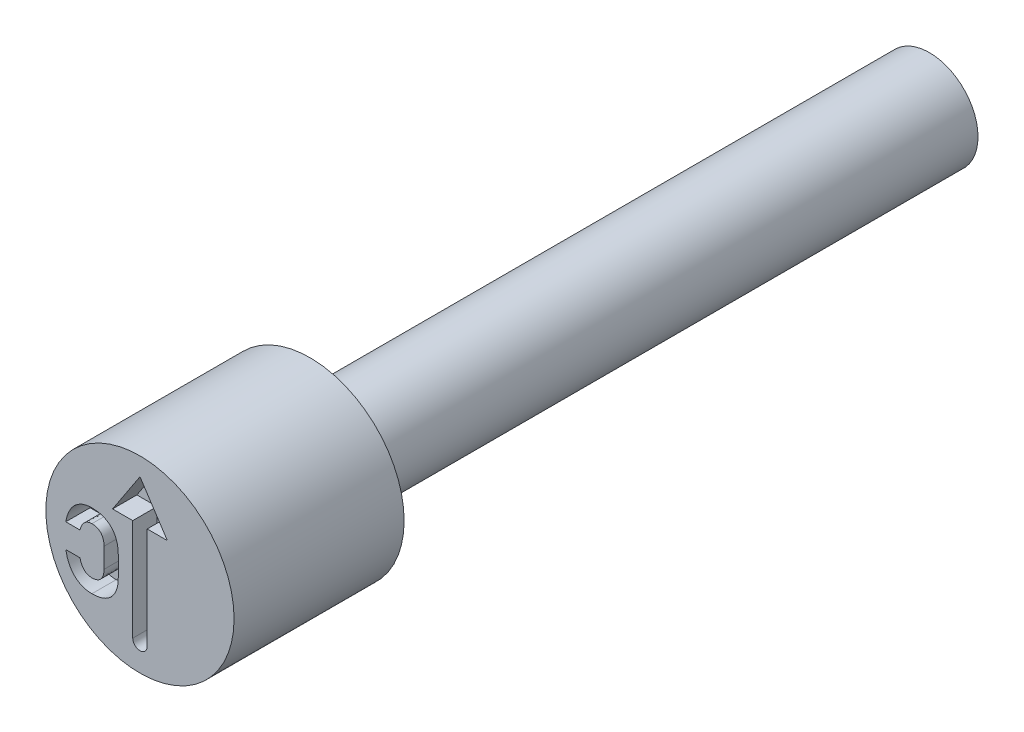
ISO-10303-21;
HEADER;
FILE_DESCRIPTION(('STEP AP214'),'2;1');
FILE_NAME('part.step','',(''),(''),'','','');
FILE_SCHEMA(('AUTOMOTIVE_DESIGN { 1 0 10303 214 1 1 1 1 }'));
ENDSEC;
DATA;
#1=APPLICATION_CONTEXT('core data for automotive mechanical design processes');
#2=APPLICATION_PROTOCOL_DEFINITION('international standard','automotive_design',2000,#1);
#3=PRODUCT_CONTEXT('',#1,'mechanical');
#4=PRODUCT('Part','Part','',(#3));
#5=PRODUCT_RELATED_PRODUCT_CATEGORY('part','',(#4));
#6=PRODUCT_DEFINITION_FORMATION('','',#4);
#7=PRODUCT_DEFINITION_CONTEXT('part definition',#1,'design');
#8=PRODUCT_DEFINITION('design','',#6,#7);
#9=PRODUCT_DEFINITION_SHAPE('','',#8);
#10=(LENGTH_UNIT() NAMED_UNIT(*) SI_UNIT(.MILLI.,.METRE.));
#11=(NAMED_UNIT(*) PLANE_ANGLE_UNIT() SI_UNIT($,.RADIAN.));
#12=(NAMED_UNIT(*) SI_UNIT($,.STERADIAN.) SOLID_ANGLE_UNIT());
#13=UNCERTAINTY_MEASURE_WITH_UNIT(LENGTH_MEASURE(1.E-05),#10,'distance_accuracy_value','');
#14=(GEOMETRIC_REPRESENTATION_CONTEXT(3) GLOBAL_UNCERTAINTY_ASSIGNED_CONTEXT((#13)) GLOBAL_UNIT_ASSIGNED_CONTEXT((#10,
#11,#12)) REPRESENTATION_CONTEXT('',''));
#15=CARTESIAN_POINT('',(0.,0.,0.));
#16=DIRECTION('',(0.,0.,1.));
#17=DIRECTION('',(1.,0.,0.));
#18=AXIS2_PLACEMENT_3D('',#15,#16,#17);
#19=CARTESIAN_POINT('',(0.,0.799999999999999,-2.8));
#20=DIRECTION('',(0.,0.,1.));
#21=DIRECTION('',(1.,0.,0.));
#22=AXIS2_PLACEMENT_3D('',#19,#20,#21);
#23=PLANE('',#22);
#24=CARTESIAN_POINT('',(0.,0.,-2.8));
#25=DIRECTION('',(0.,0.,1.));
#26=DIRECTION('',(1.,0.,0.));
#27=AXIS2_PLACEMENT_3D('',#24,#25,#26);
#28=CIRCLE('',#27,1.55);
#29=CARTESIAN_POINT('',(1.55,0.,-2.8));
#30=VERTEX_POINT('',#29);
#31=EDGE_CURVE('E11',#30,#30,#28,.T.);
#32=ORIENTED_EDGE('',*,*,#31,.F.);
#33=EDGE_LOOP('',(#32));
#34=FACE_BOUND('',#33,.T.);
#35=CARTESIAN_POINT('',(0.,0.,-2.8));
#36=DIRECTION('',(0.,0.,1.));
#37=DIRECTION('',(1.,0.,0.));
#38=AXIS2_PLACEMENT_3D('',#35,#36,#37);
#39=CIRCLE('',#38,0.799999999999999);
#40=CARTESIAN_POINT('',(0.799999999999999,0.,-2.8));
#41=VERTEX_POINT('',#40);
#42=EDGE_CURVE('E262',#41,#41,#39,.T.);
#43=ORIENTED_EDGE('',*,*,#42,.T.);
#44=EDGE_LOOP('',(#43));
#45=FACE_BOUND('',#44,.T.);
#46=ADVANCED_FACE('F34',(#34,#45),#23,.F.);
#47=CARTESIAN_POINT('',(0.,0.,-0.403888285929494));
#48=DIRECTION('',(0.,0.,1.));
#49=DIRECTION('',(1.,0.,0.));
#50=AXIS2_PLACEMENT_3D('',#47,#48,#49);
#51=CYLINDRICAL_SURFACE('',#50,1.55);
#52=CARTESIAN_POINT('',(0.,0.,0.));
#53=DIRECTION('',(0.,0.,1.));
#54=DIRECTION('',(1.,0.,0.));
#55=AXIS2_PLACEMENT_3D('',#52,#53,#54);
#56=CIRCLE('',#55,1.55);
#57=CARTESIAN_POINT('',(1.55,0.,0.));
#58=VERTEX_POINT('',#57);
#59=EDGE_CURVE('E41',#58,#58,#56,.T.);
#60=ORIENTED_EDGE('',*,*,#59,.F.);
#61=EDGE_LOOP('',(#60));
#62=FACE_BOUND('',#61,.T.);
#63=ORIENTED_EDGE('',*,*,#31,.T.);
#64=EDGE_LOOP('',(#63));
#65=FACE_BOUND('',#64,.T.);
#66=ADVANCED_FACE('F247',(#62,#65),#51,.T.);
#67=CARTESIAN_POINT('',(0.,1.55,0.));
#68=DIRECTION('',(0.,0.,-1.));
#69=DIRECTION('',(-1.,0.,0.));
#70=AXIS2_PLACEMENT_3D('',#67,#68,#69);
#71=PLANE('',#70);
#72=CARTESIAN_POINT('',(-0.791430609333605,-0.812471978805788,0.));
#73=CARTESIAN_POINT('',(-0.780258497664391,-0.812351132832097,0.));
#74=CARTESIAN_POINT('',(-0.758212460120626,-0.812112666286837,0.));
#75=CARTESIAN_POINT('',(-0.725795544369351,-0.809631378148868,0.));
#76=CARTESIAN_POINT('',(-0.694521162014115,-0.805483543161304,0.));
#77=CARTESIAN_POINT('',(-0.66455986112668,-0.799634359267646,0.));
#78=CARTESIAN_POINT('',(-0.635828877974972,-0.792255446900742,0.));
#79=CARTESIAN_POINT('',(-0.608205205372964,-0.783533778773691,0.));
#80=CARTESIAN_POINT('',(-0.581954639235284,-0.772736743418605,0.));
#81=CARTESIAN_POINT('',(-0.556822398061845,-0.760492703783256,0.));
#82=CARTESIAN_POINT('',(-0.53316239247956,-0.746634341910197,0.));
#83=CARTESIAN_POINT('',(-0.511024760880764,-0.731046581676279,0.));
#84=CARTESIAN_POINT('',(-0.490189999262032,-0.714218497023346,0.));
#85=CARTESIAN_POINT('',(-0.470816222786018,-0.695812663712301,0.));
#86=CARTESIAN_POINT('',(-0.452923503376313,-0.675936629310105,0.));
#87=CARTESIAN_POINT('',(-0.436410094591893,-0.65456836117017,0.));
#88=CARTESIAN_POINT('',(-0.421615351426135,-0.631571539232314,0.));
#89=CARTESIAN_POINT('',(-0.408081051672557,-0.607256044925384,0.));
#90=CARTESIAN_POINT('',(-0.396039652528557,-0.58155541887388,0.));
#91=CARTESIAN_POINT('',(-0.385876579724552,-0.55434699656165,0.));
#92=CARTESIAN_POINT('',(-0.377065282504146,-0.525931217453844,0.));
#93=CARTESIAN_POINT('',(-0.36969451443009,-0.496312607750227,0.));
#94=CARTESIAN_POINT('',(-0.364051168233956,-0.465356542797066,0.));
#95=CARTESIAN_POINT('',(-0.360289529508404,-0.433086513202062,0.));
#96=CARTESIAN_POINT('',(-0.357681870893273,-0.39947214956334,0.));
#97=CARTESIAN_POINT('',(-0.357466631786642,-0.376610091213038,0.));
#98=CARTESIAN_POINT('',(-0.357356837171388,-0.364948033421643,0.));
#99=B_SPLINE_CURVE_WITH_KNOTS('',3,(#72,#73,#74,#75,#76,#77,#78,#79,#80,#81,#82,#83,#84,#85,#86,
#87,#88,#89,#90,#91,#92,#93,#94,#95,#96,#97,#98),.UNSPECIFIED.,.F.,.F.,(4,1,1,1,1,1,1,1,1,1,1,1,
1,1,1,1,1,1,1,1,1,1,1,1,4),(0.,0.04725989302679,0.0932584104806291,0.137448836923,
0.180669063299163,0.222325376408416,0.262898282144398,0.303117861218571,0.342294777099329,
0.381096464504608,0.418984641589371,0.456742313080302,0.494310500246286,0.531916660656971,
0.569787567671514,0.608434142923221,0.647492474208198,0.687453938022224,0.728384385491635,
0.770272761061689,0.813266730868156,0.85743965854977,0.903297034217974,0.950671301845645,1.),.UNSPECIFIED.);
#100=CARTESIAN_POINT('',(-0.791430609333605,-0.812471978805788,0.));
#101=VERTEX_POINT('',#100);
#102=CARTESIAN_POINT('',(-0.357356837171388,-0.364948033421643,0.));
#103=VERTEX_POINT('',#102);
#104=EDGE_CURVE('E400',#101,#103,#99,.T.);
#105=ORIENTED_EDGE('',*,*,#104,.F.);
#106=CARTESIAN_POINT('',(-1.22134705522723,-0.397962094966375,0.));
#107=CARTESIAN_POINT('',(-1.2171676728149,-0.419166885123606,0.));
#108=CARTESIAN_POINT('',(-1.20904219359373,-0.460392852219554,0.));
#109=CARTESIAN_POINT('',(-1.19078283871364,-0.519101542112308,0.));
#110=CARTESIAN_POINT('',(-1.16828133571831,-0.573041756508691,0.));
#111=CARTESIAN_POINT('',(-1.14150329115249,-0.62213258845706,0.));
#112=CARTESIAN_POINT('',(-1.11028545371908,-0.665888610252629,0.));
#113=CARTESIAN_POINT('',(-1.07537476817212,-0.704473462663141,0.));
#114=CARTESIAN_POINT('',(-1.03647621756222,-0.737561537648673,0.));
#115=CARTESIAN_POINT('',(-0.993669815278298,-0.764820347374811,0.));
#116=CARTESIAN_POINT('',(-0.947448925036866,-0.786249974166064,0.));
#117=CARTESIAN_POINT('',(-0.898066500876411,-0.80129948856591,0.));
#118=CARTESIAN_POINT('',(-0.845777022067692,-0.811035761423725,0.));
#119=CARTESIAN_POINT('',(-0.809816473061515,-0.811986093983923,0.));
#120=CARTESIAN_POINT('',(-0.791430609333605,-0.812471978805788,0.));
#121=B_SPLINE_CURVE_WITH_KNOTS('',3,(#106,#107,#108,#109,#110,#111,#112,#113,#114,#115,#116,
#117,#118,#119,#120),.UNSPECIFIED.,.F.,.F.,(4,1,1,1,1,1,1,1,1,1,1,1,4),(0.,0.0988237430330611,
0.192131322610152,0.28071953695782,0.365844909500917,0.447392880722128,0.52606487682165,
0.603327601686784,0.680299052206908,0.757555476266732,0.835645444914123,0.915969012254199,1.),.UNSPECIFIED.);
#122=CARTESIAN_POINT('',(-1.22134705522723,-0.397962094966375,0.));
#123=VERTEX_POINT('',#122);
#124=EDGE_CURVE('E48',#123,#101,#121,.T.);
#125=ORIENTED_EDGE('',*,*,#124,.F.);
#126=DIRECTION('',(-1.,0.,0.));
#127=VECTOR('',#126,1.);
#128=CARTESIAN_POINT('',(-0.987069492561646,-0.397962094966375,0.));
#129=LINE('',#128,#127);
#130=CARTESIAN_POINT('',(-0.987069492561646,-0.397962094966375,0.));
#131=VERTEX_POINT('',#130);
#132=EDGE_CURVE('E185',#131,#123,#129,.T.);
#133=ORIENTED_EDGE('',*,*,#132,.F.);
#134=CARTESIAN_POINT('',(-0.791430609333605,-0.586264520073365,0.));
#135=CARTESIAN_POINT('',(-0.799513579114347,-0.585946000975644,0.));
#136=CARTESIAN_POINT('',(-0.815367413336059,-0.585321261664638,0.));
#137=CARTESIAN_POINT('',(-0.838528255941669,-0.581496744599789,0.));
#138=CARTESIAN_POINT('',(-0.86033493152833,-0.57444835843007,0.));
#139=CARTESIAN_POINT('',(-0.880934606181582,-0.564951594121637,0.));
#140=CARTESIAN_POINT('',(-0.900176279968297,-0.552681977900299,0.));
#141=CARTESIAN_POINT('',(-0.917511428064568,-0.537522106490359,0.));
#142=CARTESIAN_POINT('',(-0.933658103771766,-0.520265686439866,0.));
#143=CARTESIAN_POINT('',(-0.948029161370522,-0.500350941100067,0.));
#144=CARTESIAN_POINT('',(-0.960768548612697,-0.47806525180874,0.));
#145=CARTESIAN_POINT('',(-0.971422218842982,-0.453400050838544,0.));
#146=CARTESIAN_POINT('',(-0.980669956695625,-0.426630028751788,0.));
#147=CARTESIAN_POINT('',(-0.984892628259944,-0.407713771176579,0.));
#148=CARTESIAN_POINT('',(-0.987069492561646,-0.397962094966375,0.));
#149=B_SPLINE_CURVE_WITH_KNOTS('',3,(#134,#135,#136,#137,#138,#139,#140,#141,#142,#143,#144,
#145,#146,#147,#148),.UNSPECIFIED.,.F.,.F.,(4,1,1,1,1,1,1,1,1,1,1,1,4),(0.,0.0817564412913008,
0.160356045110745,0.236478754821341,0.312819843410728,0.389192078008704,0.466352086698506,
0.545094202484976,0.627698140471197,0.714093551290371,0.80415108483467,0.89903630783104,1.),.UNSPECIFIED.);
#150=CARTESIAN_POINT('',(-0.791430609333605,-0.586264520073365,0.));
#151=VERTEX_POINT('',#150);
#152=EDGE_CURVE('E188',#151,#131,#149,.T.);
#153=ORIENTED_EDGE('',*,*,#152,.F.);
#154=CARTESIAN_POINT('',(-0.591634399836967,-0.364948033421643,0.));
#155=CARTESIAN_POINT('',(-0.591898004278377,-0.376212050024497,0.));
#156=CARTESIAN_POINT('',(-0.592408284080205,-0.398016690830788,0.));
#157=CARTESIAN_POINT('',(-0.596829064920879,-0.429429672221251,0.));
#158=CARTESIAN_POINT('',(-0.604142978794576,-0.4583247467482,0.));
#159=CARTESIAN_POINT('',(-0.614290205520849,-0.484652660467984,0.));
#160=CARTESIAN_POINT('',(-0.62761931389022,-0.508037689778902,0.));
#161=CARTESIAN_POINT('',(-0.643448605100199,-0.528668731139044,0.));
#162=CARTESIAN_POINT('',(-0.661869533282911,-0.546495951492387,0.));
#163=CARTESIAN_POINT('',(-0.683168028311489,-0.561000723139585,0.));
#164=CARTESIAN_POINT('',(-0.706927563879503,-0.572346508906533,0.));
#165=CARTESIAN_POINT('',(-0.733057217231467,-0.580321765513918,0.));
#166=CARTESIAN_POINT('',(-0.76148736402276,-0.585328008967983,0.));
#167=CARTESIAN_POINT('',(-0.781219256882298,-0.585945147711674,0.));
#168=CARTESIAN_POINT('',(-0.791430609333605,-0.586264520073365,0.));
#169=B_SPLINE_CURVE_WITH_KNOTS('',3,(#154,#155,#156,#157,#158,#159,#160,#161,#162,#163,#164,
#165,#166,#167,#168),.UNSPECIFIED.,.F.,.F.,(4,1,1,1,1,1,1,1,1,1,1,1,4),(0.,0.0997433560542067,
0.193081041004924,0.280299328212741,0.363302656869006,0.442209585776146,0.517891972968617,
0.592965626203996,0.668275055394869,0.745143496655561,0.825309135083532,0.909596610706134,1.),.UNSPECIFIED.);
#170=CARTESIAN_POINT('',(-0.591634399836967,-0.364948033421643,0.));
#171=VERTEX_POINT('',#170);
#172=EDGE_CURVE('E348',#171,#151,#169,.T.);
#173=ORIENTED_EDGE('',*,*,#172,.F.);
#174=DIRECTION('',(0.,-1.,0.));
#175=VECTOR('',#174,1.);
#176=CARTESIAN_POINT('',(-0.591634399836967,-0.0357856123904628,0.));
#177=LINE('',#176,#175);
#178=CARTESIAN_POINT('',(-0.591634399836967,-0.0357856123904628,0.));
#179=VERTEX_POINT('',#178);
#180=EDGE_CURVE('E356',#179,#171,#177,.T.);
#181=ORIENTED_EDGE('',*,*,#180,.F.);
#182=CARTESIAN_POINT('',(-0.791430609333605,0.186264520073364,0.));
#183=CARTESIAN_POINT('',(-0.781226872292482,0.185907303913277,0.));
#184=CARTESIAN_POINT('',(-0.761523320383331,0.185217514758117,0.));
#185=CARTESIAN_POINT('',(-0.732979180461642,0.180723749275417,0.));
#186=CARTESIAN_POINT('',(-0.706978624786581,0.172258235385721,0.));
#187=CARTESIAN_POINT('',(-0.683158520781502,0.161027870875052,0.));
#188=CARTESIAN_POINT('',(-0.661879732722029,0.146482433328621,0.));
#189=CARTESIAN_POINT('',(-0.643370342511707,0.128650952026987,0.));
#190=CARTESIAN_POINT('',(-0.627621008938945,0.107775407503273,0.));
#191=CARTESIAN_POINT('',(-0.614349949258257,0.0842150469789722,0.));
#192=CARTESIAN_POINT('',(-0.604088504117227,0.0577700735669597,0.));
#193=CARTESIAN_POINT('',(-0.59686841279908,0.0287667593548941,0.));
#194=CARTESIAN_POINT('',(-0.592400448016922,-0.00271483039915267,0.));
#195=CARTESIAN_POINT('',(-0.591895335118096,-0.0245208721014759,0.));
#196=CARTESIAN_POINT('',(-0.591634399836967,-0.0357856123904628,0.));
#197=B_SPLINE_CURVE_WITH_KNOTS('',3,(#182,#183,#184,#185,#186,#187,#188,#189,#190,#191,#192,
#193,#194,#195,#196),.UNSPECIFIED.,.F.,.F.,(4,1,1,1,1,1,1,1,1,1,1,1,4),(0.,0.0902231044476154,
0.174222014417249,0.25444494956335,0.331160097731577,0.406319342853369,0.481243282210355,
0.557346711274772,0.636723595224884,0.719561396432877,0.807304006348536,0.900455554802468,1.),.UNSPECIFIED.);
#198=CARTESIAN_POINT('',(-0.791430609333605,0.186264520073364,0.));
#199=VERTEX_POINT('',#198);
#200=EDGE_CURVE('E362',#199,#179,#197,.T.);
#201=ORIENTED_EDGE('',*,*,#200,.F.);
#202=CARTESIAN_POINT('',(-0.987069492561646,-0.00179335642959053,0.));
#203=CARTESIAN_POINT('',(-0.984706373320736,0.00779221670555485,0.));
#204=CARTESIAN_POINT('',(-0.980107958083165,0.0264448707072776,0.));
#205=CARTESIAN_POINT('',(-0.97064015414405,0.0529798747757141,0.));
#206=CARTESIAN_POINT('',(-0.959874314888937,0.0775584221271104,0.));
#207=CARTESIAN_POINT('',(-0.946707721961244,0.0995949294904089,0.));
#208=CARTESIAN_POINT('',(-0.932374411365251,0.11962144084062,0.));
#209=CARTESIAN_POINT('',(-0.916209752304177,0.136971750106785,0.));
#210=CARTESIAN_POINT('',(-0.898567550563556,0.151933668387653,0.));
#211=CARTESIAN_POINT('',(-0.879584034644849,0.164308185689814,0.));
#212=CARTESIAN_POINT('',(-0.859310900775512,0.17439320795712,0.));
#213=CARTESIAN_POINT('',(-0.837655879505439,0.181067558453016,0.));
#214=CARTESIAN_POINT('',(-0.814917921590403,0.185425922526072,0.));
#215=CARTESIAN_POINT('',(-0.799358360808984,0.185981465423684,0.));
#216=CARTESIAN_POINT('',(-0.791430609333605,0.186264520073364,0.));
#217=B_SPLINE_CURVE_WITH_KNOTS('',3,(#202,#203,#204,#205,#206,#207,#208,#209,#210,#211,#212,
#213,#214,#215,#216),.UNSPECIFIED.,.F.,.F.,(4,1,1,1,1,1,1,1,1,1,1,1,4),(0.,0.100258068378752,
0.195093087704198,0.285925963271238,0.37244127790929,0.455447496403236,0.535743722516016,
0.612742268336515,0.689936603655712,0.765509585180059,0.842003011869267,0.919498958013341,1.),.UNSPECIFIED.);
#218=CARTESIAN_POINT('',(-0.987069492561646,-0.00179335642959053,0.));
#219=VERTEX_POINT('',#218);
#220=EDGE_CURVE('E367',#219,#199,#217,.T.);
#221=ORIENTED_EDGE('',*,*,#220,.F.);
#222=DIRECTION('',(1.,0.,0.));
#223=VECTOR('',#222,1.);
#224=CARTESIAN_POINT('',(-1.22134705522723,-0.00179335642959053,0.));
#225=LINE('',#224,#223);
#226=CARTESIAN_POINT('',(-1.22134705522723,-0.00179335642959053,0.));
#227=VERTEX_POINT('',#226);
#228=EDGE_CURVE('E375',#227,#219,#225,.T.);
#229=ORIENTED_EDGE('',*,*,#228,.F.);
#230=CARTESIAN_POINT('',(-0.791430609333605,0.412471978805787,0.));
#231=CARTESIAN_POINT('',(-0.809815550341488,0.411979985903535,0.));
#232=CARTESIAN_POINT('',(-0.84585461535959,0.411015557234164,0.));
#233=CARTESIAN_POINT('',(-0.89823459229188,0.401332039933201,0.));
#234=CARTESIAN_POINT('',(-0.947698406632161,0.386255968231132,0.));
#235=CARTESIAN_POINT('',(-0.9939569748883,0.364758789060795,0.));
#236=CARTESIAN_POINT('',(-1.03686547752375,0.337635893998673,0.));
#237=CARTESIAN_POINT('',(-1.07592155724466,0.3046356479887,0.));
#238=CARTESIAN_POINT('',(-1.11111207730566,0.26619020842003,0.));
#239=CARTESIAN_POINT('',(-1.14213327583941,0.222142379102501,0.));
#240=CARTESIAN_POINT('',(-1.16907351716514,0.173106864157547,0.));
#241=CARTESIAN_POINT('',(-1.19125174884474,0.11907771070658,0.));
#242=CARTESIAN_POINT('',(-1.2092538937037,0.060457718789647,0.));
#243=CARTESIAN_POINT('',(-1.2172439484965,0.0193279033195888,0.));
#244=CARTESIAN_POINT('',(-1.22134705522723,-0.00179335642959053,0.));
#245=B_SPLINE_CURVE_WITH_KNOTS('',3,(#230,#231,#232,#233,#234,#235,#236,#237,#238,#239,#240,
#241,#242,#243,#244),.UNSPECIFIED.,.F.,.F.,(4,1,1,1,1,1,1,1,1,1,1,1,4),(0.,0.0840057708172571,
0.164672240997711,0.242738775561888,0.319972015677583,0.397234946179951,0.474233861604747,
0.553133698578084,0.634960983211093,0.720060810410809,0.808478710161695,0.901648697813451,1.),.UNSPECIFIED.);
#246=CARTESIAN_POINT('',(-0.791430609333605,0.412471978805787,0.));
#247=VERTEX_POINT('',#246);
#248=EDGE_CURVE('E381',#247,#227,#245,.T.);
#249=ORIENTED_EDGE('',*,*,#248,.F.);
#250=CARTESIAN_POINT('',(-0.357356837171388,-0.0357856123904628,0.));
#251=CARTESIAN_POINT('',(-0.357466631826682,-0.0241235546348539,0.));
#252=CARTESIAN_POINT('',(-0.357681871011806,-0.00126149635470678,0.));
#253=CARTESIAN_POINT('',(-0.360289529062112,0.032352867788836,0.));
#254=CARTESIAN_POINT('',(-0.364051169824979,0.0646228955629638,0.));
#255=CARTESIAN_POINT('',(-0.369694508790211,0.0955789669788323,0.));
#256=CARTESIAN_POINT('',(-0.377065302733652,0.125197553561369,0.));
#257=CARTESIAN_POINT('',(-0.385876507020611,0.153613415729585,0.));
#258=CARTESIAN_POINT('',(-0.396039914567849,0.180821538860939,0.));
#259=CARTESIAN_POINT('',(-0.408080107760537,0.206523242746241,0.));
#260=CARTESIAN_POINT('',(-0.421618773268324,0.230834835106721,0.));
#261=CARTESIAN_POINT('',(-0.436397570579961,0.253845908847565,0.));
#262=CARTESIAN_POINT('',(-0.453006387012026,0.275210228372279,0.));
#263=CARTESIAN_POINT('',(-0.470729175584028,0.295319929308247,0.));
#264=CARTESIAN_POINT('',(-0.490200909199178,0.313720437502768,0.));
#265=CARTESIAN_POINT('',(-0.511024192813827,0.330554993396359,0.));
#266=CARTESIAN_POINT('',(-0.53315359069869,0.346164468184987,0.));
#267=CARTESIAN_POINT('',(-0.556890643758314,0.35994506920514,0.));
#268=CARTESIAN_POINT('',(-0.581878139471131,0.372572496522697,0.));
#269=CARTESIAN_POINT('',(-0.608264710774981,0.383198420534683,0.));
#270=CARTESIAN_POINT('',(-0.635774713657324,0.392337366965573,0.));
#271=CARTESIAN_POINT('',(-0.664568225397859,0.399609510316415,0.));
#272=CARTESIAN_POINT('',(-0.694518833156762,0.405490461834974,0.));
#273=CARTESIAN_POINT('',(-0.725796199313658,0.409629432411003,0.));
#274=CARTESIAN_POINT('',(-0.758212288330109,0.412113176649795,0.));
#275=CARTESIAN_POINT('',(-0.780258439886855,0.412351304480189,0.));
#276=CARTESIAN_POINT('',(-0.791430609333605,0.412471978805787,0.));
#277=B_SPLINE_CURVE_WITH_KNOTS('',3,(#250,#251,#252,#253,#254,#255,#256,#257,#258,#259,#260,
#261,#262,#263,#264,#265,#266,#267,#268,#269,#270,#271,#272,#273,#274,#275,#276),.UNSPECIFIED.,
.F.,.F.,(4,1,1,1,1,1,1,1,1,1,1,1,1,1,1,1,1,1,1,1,1,1,1,1,4),(0.,0.0493032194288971,
0.0966530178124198,0.142486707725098,0.186636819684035,0.229608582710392,0.271475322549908,
0.312384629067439,0.352325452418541,0.391363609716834,0.429990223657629,0.467841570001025,
0.505685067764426,0.543233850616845,0.580972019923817,0.618840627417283,0.657622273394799,
0.69693189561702,0.737130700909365,0.777789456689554,0.819424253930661,0.862622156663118,
0.906789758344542,0.952764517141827,1.),.UNSPECIFIED.);
#278=CARTESIAN_POINT('',(-0.357356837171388,-0.0357856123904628,0.));
#279=VERTEX_POINT('',#278);
#280=EDGE_CURVE('E386',#279,#247,#277,.T.);
#281=ORIENTED_EDGE('',*,*,#280,.F.);
#282=DIRECTION('',(0.,1.,0.));
#283=VECTOR('',#282,1.);
#284=CARTESIAN_POINT('',(-0.357356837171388,-0.364948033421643,0.));
#285=LINE('',#284,#283);
#286=EDGE_CURVE('E394',#103,#279,#285,.T.);
#287=ORIENTED_EDGE('',*,*,#286,.F.);
#288=EDGE_LOOP('',(#105,#125,#133,#153,#173,#181,#201,#221,#229,#249,#281,#287));
#289=FACE_BOUND('',#288,.T.);
#290=DIRECTION('',(0.,1.,0.));
#291=VECTOR('',#290,1.);
#292=CARTESIAN_POINT('',(0.119045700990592,0.566469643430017,0.));
#293=LINE('',#292,#291);
#294=CARTESIAN_POINT('',(0.119045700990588,-1.11010114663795,0.));
#295=VERTEX_POINT('',#294);
#296=CARTESIAN_POINT('',(0.119045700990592,0.566469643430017,0.));
#297=VERTEX_POINT('',#296);
#298=EDGE_CURVE('E300',#295,#297,#293,.T.);
#299=ORIENTED_EDGE('',*,*,#298,.F.);
#300=CARTESIAN_POINT('',(1.02140308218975E-13,-1.11010114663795,0.));
#301=DIRECTION('',(0.,0.,1.));
#302=DIRECTION('',(1.,0.,0.));
#303=AXIS2_PLACEMENT_3D('',#300,#301,#302);
#304=CIRCLE('',#303,0.119045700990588);
#305=CARTESIAN_POINT('',(-0.119045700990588,-1.11010114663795,0.));
#306=VERTEX_POINT('',#305);
#307=EDGE_CURVE('E56',#306,#295,#304,.T.);
#308=ORIENTED_EDGE('',*,*,#307,.F.);
#309=DIRECTION('',(0.,-1.,0.));
#310=VECTOR('',#309,1.);
#311=CARTESIAN_POINT('',(-0.119045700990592,0.566469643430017,0.));
#312=LINE('',#311,#310);
#313=CARTESIAN_POINT('',(-0.119045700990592,0.566469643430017,0.));
#314=VERTEX_POINT('',#313);
#315=EDGE_CURVE('E284',#314,#306,#312,.T.);
#316=ORIENTED_EDGE('',*,*,#315,.F.);
#317=DIRECTION('',(1.,0.,0.));
#318=VECTOR('',#317,1.);
#319=CARTESIAN_POINT('',(-0.451198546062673,0.566469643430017,0.));
#320=LINE('',#319,#318);
#321=CARTESIAN_POINT('',(-0.451198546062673,0.566469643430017,0.));
#322=VERTEX_POINT('',#321);
#323=EDGE_CURVE('E288',#322,#314,#320,.T.);
#324=ORIENTED_EDGE('',*,*,#323,.F.);
#325=DIRECTION('',(-0.550159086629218,-0.835059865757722,0.));
#326=VECTOR('',#325,1.);
#327=CARTESIAN_POINT('',(0.,1.25132209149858,0.));
#328=LINE('',#327,#326);
#329=CARTESIAN_POINT('',(0.,1.25132209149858,0.));
#330=VERTEX_POINT('',#329);
#331=EDGE_CURVE('E291',#330,#322,#328,.T.);
#332=ORIENTED_EDGE('',*,*,#331,.F.);
#333=DIRECTION('',(-0.550159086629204,0.835059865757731,0.));
#334=VECTOR('',#333,1.);
#335=CARTESIAN_POINT('',(0.,1.25132209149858,0.));
#336=LINE('',#335,#334);
#337=CARTESIAN_POINT('',(0.451198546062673,0.566469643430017,0.));
#338=VERTEX_POINT('',#337);
#339=EDGE_CURVE('E294',#338,#330,#336,.T.);
#340=ORIENTED_EDGE('',*,*,#339,.F.);
#341=DIRECTION('',(1.,0.,0.));
#342=VECTOR('',#341,1.);
#343=CARTESIAN_POINT('',(0.451198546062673,0.566469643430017,0.));
#344=LINE('',#343,#342);
#345=EDGE_CURVE('E297',#297,#338,#344,.T.);
#346=ORIENTED_EDGE('',*,*,#345,.F.);
#347=EDGE_LOOP('',(#299,#308,#316,#324,#332,#340,#346));
#348=FACE_BOUND('',#347,.T.);
#349=ORIENTED_EDGE('',*,*,#59,.T.);
#350=EDGE_LOOP('',(#349));
#351=FACE_BOUND('',#350,.T.);
#352=ADVANCED_FACE('F244',(#289,#348,#351),#71,.F.);
#353=CARTESIAN_POINT('',(0.,0.,-13.));
#354=DIRECTION('',(0.,0.,1.));
#355=DIRECTION('',(1.,0.,0.));
#356=AXIS2_PLACEMENT_3D('',#353,#354,#355);
#357=PLANE('',#356);
#358=CARTESIAN_POINT('',(0.,0.,-13.));
#359=DIRECTION('',(0.,0.,1.));
#360=DIRECTION('',(1.,0.,0.));
#361=AXIS2_PLACEMENT_3D('',#358,#359,#360);
#362=CIRCLE('',#361,0.8);
#363=CARTESIAN_POINT('',(0.8,0.,-13.));
#364=VERTEX_POINT('',#363);
#365=EDGE_CURVE('E263',#364,#364,#362,.T.);
#366=ORIENTED_EDGE('',*,*,#365,.F.);
#367=EDGE_LOOP('',(#366));
#368=FACE_BOUND('',#367,.T.);
#369=ADVANCED_FACE('F240',(#368),#357,.F.);
#370=CARTESIAN_POINT('',(0.,0.,-0.403888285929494));
#371=DIRECTION('',(0.,0.,1.));
#372=DIRECTION('',(1.,0.,0.));
#373=AXIS2_PLACEMENT_3D('',#370,#371,#372);
#374=CYLINDRICAL_SURFACE('',#373,0.8);
#375=ORIENTED_EDGE('',*,*,#42,.F.);
#376=EDGE_LOOP('',(#375));
#377=FACE_BOUND('',#376,.T.);
#378=ORIENTED_EDGE('',*,*,#365,.T.);
#379=EDGE_LOOP('',(#378));
#380=FACE_BOUND('',#379,.T.);
#381=ADVANCED_FACE('F237',(#377,#380),#374,.T.);
#382=CARTESIAN_POINT('',(1.02140308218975E-13,-1.11010114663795,-0.4));
#383=DIRECTION('',(0.,0.,1.));
#384=DIRECTION('',(1.,0.,0.));
#385=AXIS2_PLACEMENT_3D('',#382,#383,#384);
#386=CYLINDRICAL_SURFACE('',#385,0.119045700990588);
#387=ORIENTED_EDGE('',*,*,#307,.T.);
#388=DIRECTION('',(0.,0.,1.));
#389=VECTOR('',#388,1.);
#390=CARTESIAN_POINT('',(0.119045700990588,-1.11010114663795,-0.4));
#391=LINE('',#390,#389);
#392=CARTESIAN_POINT('',(0.119045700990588,-1.11010114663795,-0.4));
#393=VERTEX_POINT('',#392);
#394=EDGE_CURVE('E271',#393,#295,#391,.T.);
#395=ORIENTED_EDGE('',*,*,#394,.F.);
#396=CARTESIAN_POINT('',(1.02140308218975E-13,-1.11010114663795,-0.4));
#397=DIRECTION('',(0.,0.,1.));
#398=DIRECTION('',(1.,0.,0.));
#399=AXIS2_PLACEMENT_3D('',#396,#397,#398);
#400=CIRCLE('',#399,0.119045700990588);
#401=CARTESIAN_POINT('',(-0.119045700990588,-1.11010114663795,-0.4));
#402=VERTEX_POINT('',#401);
#403=EDGE_CURVE('E287',#402,#393,#400,.T.);
#404=ORIENTED_EDGE('',*,*,#403,.F.);
#405=DIRECTION('',(0.,0.,1.));
#406=VECTOR('',#405,1.);
#407=CARTESIAN_POINT('',(-0.119045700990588,-1.11010114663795,-0.4));
#408=LINE('',#407,#406);
#409=EDGE_CURVE('E264',#402,#306,#408,.T.);
#410=ORIENTED_EDGE('',*,*,#409,.T.);
#411=EDGE_LOOP('',(#387,#395,#404,#410));
#412=FACE_BOUND('',#411,.T.);
#413=ADVANCED_FACE('F215',(#412),#386,.F.);
#414=CARTESIAN_POINT('',(-0.119045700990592,0.566469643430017,-0.4));
#415=DIRECTION('',(-1.,0.,0.));
#416=DIRECTION('',(0.,-1.,0.));
#417=AXIS2_PLACEMENT_3D('',#414,#415,#416);
#418=PLANE('',#417);
#419=ORIENTED_EDGE('',*,*,#315,.T.);
#420=ORIENTED_EDGE('',*,*,#409,.F.);
#421=DIRECTION('',(0.,-1.,0.));
#422=VECTOR('',#421,1.);
#423=CARTESIAN_POINT('',(-0.119045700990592,0.566469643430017,-0.4));
#424=LINE('',#423,#422);
#425=CARTESIAN_POINT('',(-0.119045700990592,0.566469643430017,-0.4));
#426=VERTEX_POINT('',#425);
#427=EDGE_CURVE('E275',#426,#402,#424,.T.);
#428=ORIENTED_EDGE('',*,*,#427,.F.);
#429=DIRECTION('',(0.,0.,1.));
#430=VECTOR('',#429,1.);
#431=CARTESIAN_POINT('',(-0.119045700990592,0.566469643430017,-0.4));
#432=LINE('',#431,#430);
#433=EDGE_CURVE('E268',#426,#314,#432,.T.);
#434=ORIENTED_EDGE('',*,*,#433,.T.);
#435=EDGE_LOOP('',(#419,#420,#428,#434));
#436=FACE_BOUND('',#435,.T.);
#437=ADVANCED_FACE('F211',(#436),#418,.F.);
#438=CARTESIAN_POINT('',(-0.451198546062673,0.566469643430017,-0.4));
#439=DIRECTION('',(0.,-1.,0.));
#440=DIRECTION('',(0.,0.,-1.));
#441=AXIS2_PLACEMENT_3D('',#438,#439,#440);
#442=PLANE('',#441);
#443=ORIENTED_EDGE('',*,*,#323,.T.);
#444=ORIENTED_EDGE('',*,*,#433,.F.);
#445=DIRECTION('',(1.,0.,0.));
#446=VECTOR('',#445,1.);
#447=CARTESIAN_POINT('',(-0.451198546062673,0.566469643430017,-0.4));
#448=LINE('',#447,#446);
#449=CARTESIAN_POINT('',(-0.451198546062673,0.566469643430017,-0.4));
#450=VERTEX_POINT('',#449);
#451=EDGE_CURVE('E307',#450,#426,#448,.T.);
#452=ORIENTED_EDGE('',*,*,#451,.F.);
#453=DIRECTION('',(0.,0.,1.));
#454=VECTOR('',#453,1.);
#455=CARTESIAN_POINT('',(-0.451198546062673,0.566469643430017,-0.4));
#456=LINE('',#455,#454);
#457=EDGE_CURVE('E281',#450,#322,#456,.T.);
#458=ORIENTED_EDGE('',*,*,#457,.T.);
#459=EDGE_LOOP('',(#443,#444,#452,#458));
#460=FACE_BOUND('',#459,.T.);
#461=ADVANCED_FACE('F214',(#460),#442,.F.);
#462=CARTESIAN_POINT('',(0.,1.25132209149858,-0.4));
#463=DIRECTION('',(-0.835059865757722,0.550159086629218,0.));
#464=DIRECTION('',(-0.550159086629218,-0.835059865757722,0.));
#465=AXIS2_PLACEMENT_3D('',#462,#463,#464);
#466=PLANE('',#465);
#467=ORIENTED_EDGE('',*,*,#331,.T.);
#468=ORIENTED_EDGE('',*,*,#457,.F.);
#469=DIRECTION('',(-0.550159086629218,-0.835059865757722,0.));
#470=VECTOR('',#469,1.);
#471=CARTESIAN_POINT('',(0.,1.25132209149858,-0.4));
#472=LINE('',#471,#470);
#473=CARTESIAN_POINT('',(0.,1.25132209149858,-0.4));
#474=VERTEX_POINT('',#473);
#475=EDGE_CURVE('E310',#474,#450,#472,.T.);
#476=ORIENTED_EDGE('',*,*,#475,.F.);
#477=DIRECTION('',(0.,0.,1.));
#478=VECTOR('',#477,1.);
#479=CARTESIAN_POINT('',(0.,1.25132209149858,-0.4));
#480=LINE('',#479,#478);
#481=EDGE_CURVE('E279',#474,#330,#480,.T.);
#482=ORIENTED_EDGE('',*,*,#481,.T.);
#483=EDGE_LOOP('',(#467,#468,#476,#482));
#484=FACE_BOUND('',#483,.T.);
#485=ADVANCED_FACE('F219',(#484),#466,.F.);
#486=CARTESIAN_POINT('',(0.,1.25132209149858,-0.4));
#487=DIRECTION('',(0.835059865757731,0.550159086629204,0.));
#488=DIRECTION('',(-0.550159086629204,0.835059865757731,0.));
#489=AXIS2_PLACEMENT_3D('',#486,#487,#488);
#490=PLANE('',#489);
#491=ORIENTED_EDGE('',*,*,#339,.T.);
#492=ORIENTED_EDGE('',*,*,#481,.F.);
#493=DIRECTION('',(-0.550159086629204,0.835059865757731,0.));
#494=VECTOR('',#493,1.);
#495=CARTESIAN_POINT('',(0.,1.25132209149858,-0.4));
#496=LINE('',#495,#494);
#497=CARTESIAN_POINT('',(0.451198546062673,0.566469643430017,-0.4));
#498=VERTEX_POINT('',#497);
#499=EDGE_CURVE('E313',#498,#474,#496,.T.);
#500=ORIENTED_EDGE('',*,*,#499,.F.);
#501=DIRECTION('',(0.,0.,1.));
#502=VECTOR('',#501,1.);
#503=CARTESIAN_POINT('',(0.451198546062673,0.566469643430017,-0.4));
#504=LINE('',#503,#502);
#505=EDGE_CURVE('E277',#498,#338,#504,.T.);
#506=ORIENTED_EDGE('',*,*,#505,.T.);
#507=EDGE_LOOP('',(#491,#492,#500,#506));
#508=FACE_BOUND('',#507,.T.);
#509=ADVANCED_FACE('F223',(#508),#490,.F.);
#510=CARTESIAN_POINT('',(0.451198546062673,0.566469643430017,-0.4));
#511=DIRECTION('',(0.,-1.,0.));
#512=DIRECTION('',(0.,0.,-1.));
#513=AXIS2_PLACEMENT_3D('',#510,#511,#512);
#514=PLANE('',#513);
#515=ORIENTED_EDGE('',*,*,#345,.T.);
#516=ORIENTED_EDGE('',*,*,#505,.F.);
#517=DIRECTION('',(1.,0.,0.));
#518=VECTOR('',#517,1.);
#519=CARTESIAN_POINT('',(0.451198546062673,0.566469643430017,-0.4));
#520=LINE('',#519,#518);
#521=CARTESIAN_POINT('',(0.119045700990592,0.566469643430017,-0.4));
#522=VERTEX_POINT('',#521);
#523=EDGE_CURVE('E316',#522,#498,#520,.T.);
#524=ORIENTED_EDGE('',*,*,#523,.F.);
#525=DIRECTION('',(0.,0.,1.));
#526=VECTOR('',#525,1.);
#527=CARTESIAN_POINT('',(0.119045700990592,0.566469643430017,-0.4));
#528=LINE('',#527,#526);
#529=EDGE_CURVE('E274',#522,#297,#528,.T.);
#530=ORIENTED_EDGE('',*,*,#529,.T.);
#531=EDGE_LOOP('',(#515,#516,#524,#530));
#532=FACE_BOUND('',#531,.T.);
#533=ADVANCED_FACE('F227',(#532),#514,.F.);
#534=CARTESIAN_POINT('',(0.119045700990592,0.566469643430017,-0.4));
#535=DIRECTION('',(1.,0.,0.));
#536=DIRECTION('',(0.,1.,0.));
#537=AXIS2_PLACEMENT_3D('',#534,#535,#536);
#538=PLANE('',#537);
#539=ORIENTED_EDGE('',*,*,#298,.T.);
#540=ORIENTED_EDGE('',*,*,#529,.F.);
#541=DIRECTION('',(0.,1.,0.));
#542=VECTOR('',#541,1.);
#543=CARTESIAN_POINT('',(0.119045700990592,0.566469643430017,-0.4));
#544=LINE('',#543,#542);
#545=EDGE_CURVE('E319',#393,#522,#544,.T.);
#546=ORIENTED_EDGE('',*,*,#545,.F.);
#547=ORIENTED_EDGE('',*,*,#394,.T.);
#548=EDGE_LOOP('',(#539,#540,#546,#547));
#549=FACE_BOUND('',#548,.T.);
#550=ADVANCED_FACE('F209',(#549),#538,.F.);
#551=CARTESIAN_POINT('',(1.02140308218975E-13,-1.11010114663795,-0.4));
#552=DIRECTION('',(0.,0.,1.));
#553=DIRECTION('',(1.,0.,0.));
#554=AXIS2_PLACEMENT_3D('',#551,#552,#553);
#555=PLANE('',#554);
#556=ORIENTED_EDGE('',*,*,#403,.T.);
#557=ORIENTED_EDGE('',*,*,#545,.T.);
#558=ORIENTED_EDGE('',*,*,#523,.T.);
#559=ORIENTED_EDGE('',*,*,#499,.T.);
#560=ORIENTED_EDGE('',*,*,#475,.T.);
#561=ORIENTED_EDGE('',*,*,#451,.T.);
#562=ORIENTED_EDGE('',*,*,#427,.T.);
#563=EDGE_LOOP('',(#556,#557,#558,#559,#560,#561,#562));
#564=FACE_BOUND('',#563,.T.);
#565=ADVANCED_FACE('F205',(#564),#555,.T.);
#566=CARTESIAN_POINT('',(-1.22134705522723,-0.397962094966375,-0.4));
#567=CARTESIAN_POINT('',(-1.2171676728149,-0.419166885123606,-0.4));
#568=CARTESIAN_POINT('',(-1.20904219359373,-0.460392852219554,-0.4));
#569=CARTESIAN_POINT('',(-1.19078283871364,-0.519101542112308,-0.4));
#570=CARTESIAN_POINT('',(-1.16828133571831,-0.573041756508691,-0.4));
#571=CARTESIAN_POINT('',(-1.14150329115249,-0.62213258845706,-0.4));
#572=CARTESIAN_POINT('',(-1.11028545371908,-0.665888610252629,-0.4));
#573=CARTESIAN_POINT('',(-1.07537476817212,-0.704473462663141,-0.4));
#574=CARTESIAN_POINT('',(-1.03647621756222,-0.737561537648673,-0.4));
#575=CARTESIAN_POINT('',(-0.993669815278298,-0.764820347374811,-0.4));
#576=CARTESIAN_POINT('',(-0.947448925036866,-0.786249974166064,-0.4));
#577=CARTESIAN_POINT('',(-0.898066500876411,-0.80129948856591,-0.4));
#578=CARTESIAN_POINT('',(-0.845777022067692,-0.811035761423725,-0.4));
#579=CARTESIAN_POINT('',(-0.809816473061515,-0.811986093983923,-0.4));
#580=CARTESIAN_POINT('',(-0.791430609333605,-0.812471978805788,-0.4));
#581=B_SPLINE_CURVE_WITH_KNOTS('',3,(#566,#567,#568,#569,#570,#571,#572,#573,#574,#575,#576,
#577,#578,#579,#580),.UNSPECIFIED.,.F.,.F.,(4,1,1,1,1,1,1,1,1,1,1,1,4),(0.,0.0988237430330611,
0.192131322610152,0.28071953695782,0.365844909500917,0.447392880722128,0.52606487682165,
0.603327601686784,0.680299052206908,0.757555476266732,0.835645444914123,0.915969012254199,1.),.UNSPECIFIED.);
#582=DIRECTION('',(0.,0.,1.));
#583=VECTOR('',#582,1.);
#584=SURFACE_OF_LINEAR_EXTRUSION('',#581,#583);
#585=ORIENTED_EDGE('',*,*,#124,.T.);
#586=DIRECTION('',(0.,0.,1.));
#587=VECTOR('',#586,1.);
#588=CARTESIAN_POINT('',(-0.791430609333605,-0.812471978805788,-0.4));
#589=LINE('',#588,#587);
#590=CARTESIAN_POINT('',(-0.791430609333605,-0.812471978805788,-0.4));
#591=VERTEX_POINT('',#590);
#592=EDGE_CURVE('E162',#591,#101,#589,.T.);
#593=ORIENTED_EDGE('',*,*,#592,.F.);
#594=CARTESIAN_POINT('',(-1.22134705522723,-0.397962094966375,-0.4));
#595=VERTEX_POINT('',#594);
#596=EDGE_CURVE('E166',#595,#591,#581,.T.);
#597=ORIENTED_EDGE('',*,*,#596,.F.);
#598=DIRECTION('',(0.,0.,1.));
#599=VECTOR('',#598,1.);
#600=CARTESIAN_POINT('',(-1.22134705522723,-0.397962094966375,-0.4));
#601=LINE('',#600,#599);
#602=EDGE_CURVE('E304',#595,#123,#601,.T.);
#603=ORIENTED_EDGE('',*,*,#602,.T.);
#604=EDGE_LOOP('',(#585,#593,#597,#603));
#605=FACE_BOUND('',#604,.T.);
#606=ADVANCED_FACE('F164',(#605),#584,.F.);
#607=CARTESIAN_POINT('',(-0.987069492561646,-0.397962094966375,-0.4));
#608=DIRECTION('',(0.,1.,0.));
#609=DIRECTION('',(0.,0.,1.));
#610=AXIS2_PLACEMENT_3D('',#607,#608,#609);
#611=PLANE('',#610);
#612=ORIENTED_EDGE('',*,*,#132,.T.);
#613=ORIENTED_EDGE('',*,*,#602,.F.);
#614=DIRECTION('',(-1.,0.,0.));
#615=VECTOR('',#614,1.);
#616=CARTESIAN_POINT('',(-0.987069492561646,-0.397962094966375,-0.4));
#617=LINE('',#616,#615);
#618=CARTESIAN_POINT('',(-0.987069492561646,-0.397962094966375,-0.4));
#619=VERTEX_POINT('',#618);
#620=EDGE_CURVE('E172',#619,#595,#617,.T.);
#621=ORIENTED_EDGE('',*,*,#620,.F.);
#622=DIRECTION('',(0.,0.,1.));
#623=VECTOR('',#622,1.);
#624=CARTESIAN_POINT('',(-0.987069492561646,-0.397962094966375,-0.4));
#625=LINE('',#624,#623);
#626=EDGE_CURVE('E341',#619,#131,#625,.T.);
#627=ORIENTED_EDGE('',*,*,#626,.T.);
#628=EDGE_LOOP('',(#612,#613,#621,#627));
#629=FACE_BOUND('',#628,.T.);
#630=ADVANCED_FACE('F204',(#629),#611,.F.);
#631=CARTESIAN_POINT('',(-0.791430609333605,-0.586264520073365,-0.4));
#632=CARTESIAN_POINT('',(-0.799513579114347,-0.585946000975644,-0.4));
#633=CARTESIAN_POINT('',(-0.815367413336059,-0.585321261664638,-0.4));
#634=CARTESIAN_POINT('',(-0.838528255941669,-0.581496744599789,-0.4));
#635=CARTESIAN_POINT('',(-0.86033493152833,-0.57444835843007,-0.4));
#636=CARTESIAN_POINT('',(-0.880934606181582,-0.564951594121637,-0.4));
#637=CARTESIAN_POINT('',(-0.900176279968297,-0.552681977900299,-0.4));
#638=CARTESIAN_POINT('',(-0.917511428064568,-0.537522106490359,-0.4));
#639=CARTESIAN_POINT('',(-0.933658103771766,-0.520265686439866,-0.4));
#640=CARTESIAN_POINT('',(-0.948029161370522,-0.500350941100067,-0.4));
#641=CARTESIAN_POINT('',(-0.960768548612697,-0.47806525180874,-0.4));
#642=CARTESIAN_POINT('',(-0.971422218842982,-0.453400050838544,-0.4));
#643=CARTESIAN_POINT('',(-0.980669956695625,-0.426630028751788,-0.4));
#644=CARTESIAN_POINT('',(-0.984892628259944,-0.407713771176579,-0.4));
#645=CARTESIAN_POINT('',(-0.987069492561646,-0.397962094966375,-0.4));
#646=B_SPLINE_CURVE_WITH_KNOTS('',3,(#631,#632,#633,#634,#635,#636,#637,#638,#639,#640,#641,
#642,#643,#644,#645),.UNSPECIFIED.,.F.,.F.,(4,1,1,1,1,1,1,1,1,1,1,1,4),(0.,0.0817564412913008,
0.160356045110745,0.236478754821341,0.312819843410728,0.389192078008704,0.466352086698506,
0.545094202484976,0.627698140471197,0.714093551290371,0.80415108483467,0.89903630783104,1.),.UNSPECIFIED.);
#647=DIRECTION('',(0.,0.,1.));
#648=VECTOR('',#647,1.);
#649=SURFACE_OF_LINEAR_EXTRUSION('',#646,#648);
#650=ORIENTED_EDGE('',*,*,#152,.T.);
#651=ORIENTED_EDGE('',*,*,#626,.F.);
#652=CARTESIAN_POINT('',(-0.791430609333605,-0.586264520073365,-0.4));
#653=VERTEX_POINT('',#652);
#654=EDGE_CURVE('E414',#653,#619,#646,.T.);
#655=ORIENTED_EDGE('',*,*,#654,.F.);
#656=DIRECTION('',(0.,0.,1.));
#657=VECTOR('',#656,1.);
#658=CARTESIAN_POINT('',(-0.791430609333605,-0.586264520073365,-0.4));
#659=LINE('',#658,#657);
#660=EDGE_CURVE('E339',#653,#151,#659,.T.);
#661=ORIENTED_EDGE('',*,*,#660,.T.);
#662=EDGE_LOOP('',(#650,#651,#655,#661));
#663=FACE_BOUND('',#662,.T.);
#664=ADVANCED_FACE('F428',(#663),#649,.F.);
#665=CARTESIAN_POINT('',(-0.591634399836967,-0.364948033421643,-0.4));
#666=CARTESIAN_POINT('',(-0.591898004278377,-0.376212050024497,-0.4));
#667=CARTESIAN_POINT('',(-0.592408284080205,-0.398016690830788,-0.4));
#668=CARTESIAN_POINT('',(-0.596829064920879,-0.429429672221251,-0.4));
#669=CARTESIAN_POINT('',(-0.604142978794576,-0.4583247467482,-0.4));
#670=CARTESIAN_POINT('',(-0.614290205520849,-0.484652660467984,-0.4));
#671=CARTESIAN_POINT('',(-0.62761931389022,-0.508037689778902,-0.4));
#672=CARTESIAN_POINT('',(-0.643448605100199,-0.528668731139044,-0.4));
#673=CARTESIAN_POINT('',(-0.661869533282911,-0.546495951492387,-0.4));
#674=CARTESIAN_POINT('',(-0.683168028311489,-0.561000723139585,-0.4));
#675=CARTESIAN_POINT('',(-0.706927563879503,-0.572346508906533,-0.4));
#676=CARTESIAN_POINT('',(-0.733057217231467,-0.580321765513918,-0.4));
#677=CARTESIAN_POINT('',(-0.76148736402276,-0.585328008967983,-0.4));
#678=CARTESIAN_POINT('',(-0.781219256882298,-0.585945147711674,-0.4));
#679=CARTESIAN_POINT('',(-0.791430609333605,-0.586264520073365,-0.4));
#680=B_SPLINE_CURVE_WITH_KNOTS('',3,(#665,#666,#667,#668,#669,#670,#671,#672,#673,#674,#675,
#676,#677,#678,#679),.UNSPECIFIED.,.F.,.F.,(4,1,1,1,1,1,1,1,1,1,1,1,4),(0.,0.0997433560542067,
0.193081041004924,0.280299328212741,0.363302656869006,0.442209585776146,0.517891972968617,
0.592965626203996,0.668275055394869,0.745143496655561,0.825309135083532,0.909596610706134,1.),.UNSPECIFIED.);
#681=DIRECTION('',(0.,0.,1.));
#682=VECTOR('',#681,1.);
#683=SURFACE_OF_LINEAR_EXTRUSION('',#680,#682);
#684=ORIENTED_EDGE('',*,*,#172,.T.);
#685=ORIENTED_EDGE('',*,*,#660,.F.);
#686=CARTESIAN_POINT('',(-0.591634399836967,-0.364948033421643,-0.4));
#687=VERTEX_POINT('',#686);
#688=EDGE_CURVE('E419',#687,#653,#680,.T.);
#689=ORIENTED_EDGE('',*,*,#688,.F.);
#690=DIRECTION('',(0.,0.,1.));
#691=VECTOR('',#690,1.);
#692=CARTESIAN_POINT('',(-0.591634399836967,-0.364948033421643,-0.4));
#693=LINE('',#692,#691);
#694=EDGE_CURVE('E337',#687,#171,#693,.T.);
#695=ORIENTED_EDGE('',*,*,#694,.T.);
#696=EDGE_LOOP('',(#684,#685,#689,#695));
#697=FACE_BOUND('',#696,.T.);
#698=ADVANCED_FACE('F432',(#697),#683,.F.);
#699=CARTESIAN_POINT('',(-0.591634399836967,-0.0357856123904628,-0.4));
#700=DIRECTION('',(-1.,0.,0.));
#701=DIRECTION('',(0.,0.,1.));
#702=AXIS2_PLACEMENT_3D('',#699,#700,#701);
#703=PLANE('',#702);
#704=ORIENTED_EDGE('',*,*,#180,.T.);
#705=ORIENTED_EDGE('',*,*,#694,.F.);
#706=DIRECTION('',(0.,-1.,0.));
#707=VECTOR('',#706,1.);
#708=CARTESIAN_POINT('',(-0.591634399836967,-0.0357856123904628,-0.4));
#709=LINE('',#708,#707);
#710=CARTESIAN_POINT('',(-0.591634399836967,-0.0357856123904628,-0.4));
#711=VERTEX_POINT('',#710);
#712=EDGE_CURVE('E455',#711,#687,#709,.T.);
#713=ORIENTED_EDGE('',*,*,#712,.F.);
#714=DIRECTION('',(0.,0.,1.));
#715=VECTOR('',#714,1.);
#716=CARTESIAN_POINT('',(-0.591634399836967,-0.0357856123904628,-0.4));
#717=LINE('',#716,#715);
#718=EDGE_CURVE('E335',#711,#179,#717,.T.);
#719=ORIENTED_EDGE('',*,*,#718,.T.);
#720=EDGE_LOOP('',(#704,#705,#713,#719));
#721=FACE_BOUND('',#720,.T.);
#722=ADVANCED_FACE('F437',(#721),#703,.F.);
#723=CARTESIAN_POINT('',(-0.791430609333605,0.186264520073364,-0.4));
#724=CARTESIAN_POINT('',(-0.781226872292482,0.185907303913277,-0.4));
#725=CARTESIAN_POINT('',(-0.761523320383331,0.185217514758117,-0.4));
#726=CARTESIAN_POINT('',(-0.732979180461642,0.180723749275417,-0.4));
#727=CARTESIAN_POINT('',(-0.706978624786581,0.172258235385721,-0.4));
#728=CARTESIAN_POINT('',(-0.683158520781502,0.161027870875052,-0.4));
#729=CARTESIAN_POINT('',(-0.661879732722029,0.146482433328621,-0.4));
#730=CARTESIAN_POINT('',(-0.643370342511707,0.128650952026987,-0.4));
#731=CARTESIAN_POINT('',(-0.627621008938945,0.107775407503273,-0.4));
#732=CARTESIAN_POINT('',(-0.614349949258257,0.0842150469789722,-0.4));
#733=CARTESIAN_POINT('',(-0.604088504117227,0.0577700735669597,-0.4));
#734=CARTESIAN_POINT('',(-0.59686841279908,0.0287667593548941,-0.4));
#735=CARTESIAN_POINT('',(-0.592400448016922,-0.00271483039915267,-0.4));
#736=CARTESIAN_POINT('',(-0.591895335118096,-0.0245208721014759,-0.4));
#737=CARTESIAN_POINT('',(-0.591634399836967,-0.0357856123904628,-0.4));
#738=B_SPLINE_CURVE_WITH_KNOTS('',3,(#723,#724,#725,#726,#727,#728,#729,#730,#731,#732,#733,
#734,#735,#736,#737),.UNSPECIFIED.,.F.,.F.,(4,1,1,1,1,1,1,1,1,1,1,1,4),(0.,0.0902231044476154,
0.174222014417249,0.25444494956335,0.331160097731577,0.406319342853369,0.481243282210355,
0.557346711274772,0.636723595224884,0.719561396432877,0.807304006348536,0.900455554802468,1.),.UNSPECIFIED.);
#739=DIRECTION('',(0.,0.,1.));
#740=VECTOR('',#739,1.);
#741=SURFACE_OF_LINEAR_EXTRUSION('',#738,#740);
#742=ORIENTED_EDGE('',*,*,#200,.T.);
#743=ORIENTED_EDGE('',*,*,#718,.F.);
#744=CARTESIAN_POINT('',(-0.791430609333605,0.186264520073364,-0.4));
#745=VERTEX_POINT('',#744);
#746=EDGE_CURVE('E450',#745,#711,#738,.T.);
#747=ORIENTED_EDGE('',*,*,#746,.F.);
#748=DIRECTION('',(0.,0.,1.));
#749=VECTOR('',#748,1.);
#750=CARTESIAN_POINT('',(-0.791430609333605,0.186264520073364,-0.4));
#751=LINE('',#750,#749);
#752=EDGE_CURVE('E333',#745,#199,#751,.T.);
#753=ORIENTED_EDGE('',*,*,#752,.T.);
#754=EDGE_LOOP('',(#742,#743,#747,#753));
#755=FACE_BOUND('',#754,.T.);
#756=ADVANCED_FACE('F441',(#755),#741,.F.);
#757=CARTESIAN_POINT('',(-0.987069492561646,-0.00179335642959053,-0.4));
#758=CARTESIAN_POINT('',(-0.984706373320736,0.00779221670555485,-0.4));
#759=CARTESIAN_POINT('',(-0.980107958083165,0.0264448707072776,-0.4));
#760=CARTESIAN_POINT('',(-0.97064015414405,0.0529798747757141,-0.4));
#761=CARTESIAN_POINT('',(-0.959874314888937,0.0775584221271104,-0.4));
#762=CARTESIAN_POINT('',(-0.946707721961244,0.0995949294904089,-0.4));
#763=CARTESIAN_POINT('',(-0.932374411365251,0.11962144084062,-0.4));
#764=CARTESIAN_POINT('',(-0.916209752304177,0.136971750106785,-0.4));
#765=CARTESIAN_POINT('',(-0.898567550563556,0.151933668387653,-0.4));
#766=CARTESIAN_POINT('',(-0.879584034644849,0.164308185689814,-0.4));
#767=CARTESIAN_POINT('',(-0.859310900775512,0.17439320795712,-0.4));
#768=CARTESIAN_POINT('',(-0.837655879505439,0.181067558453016,-0.4));
#769=CARTESIAN_POINT('',(-0.814917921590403,0.185425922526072,-0.4));
#770=CARTESIAN_POINT('',(-0.799358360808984,0.185981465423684,-0.4));
#771=CARTESIAN_POINT('',(-0.791430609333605,0.186264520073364,-0.4));
#772=B_SPLINE_CURVE_WITH_KNOTS('',3,(#757,#758,#759,#760,#761,#762,#763,#764,#765,#766,#767,
#768,#769,#770,#771),.UNSPECIFIED.,.F.,.F.,(4,1,1,1,1,1,1,1,1,1,1,1,4),(0.,0.100258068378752,
0.195093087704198,0.285925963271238,0.37244127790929,0.455447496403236,0.535743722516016,
0.612742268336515,0.689936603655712,0.765509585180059,0.842003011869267,0.919498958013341,1.),.UNSPECIFIED.);
#773=DIRECTION('',(0.,0.,1.));
#774=VECTOR('',#773,1.);
#775=SURFACE_OF_LINEAR_EXTRUSION('',#772,#774);
#776=ORIENTED_EDGE('',*,*,#220,.T.);
#777=ORIENTED_EDGE('',*,*,#752,.F.);
#778=CARTESIAN_POINT('',(-0.987069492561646,-0.00179335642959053,-0.4));
#779=VERTEX_POINT('',#778);
#780=EDGE_CURVE('E456',#779,#745,#772,.T.);
#781=ORIENTED_EDGE('',*,*,#780,.F.);
#782=DIRECTION('',(0.,0.,1.));
#783=VECTOR('',#782,1.);
#784=CARTESIAN_POINT('',(-0.987069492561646,-0.00179335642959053,-0.4));
#785=LINE('',#784,#783);
#786=EDGE_CURVE('E331',#779,#219,#785,.T.);
#787=ORIENTED_EDGE('',*,*,#786,.T.);
#788=EDGE_LOOP('',(#776,#777,#781,#787));
#789=FACE_BOUND('',#788,.T.);
#790=ADVANCED_FACE('F446',(#789),#775,.F.);
#791=CARTESIAN_POINT('',(-1.22134705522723,-0.00179335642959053,-0.4));
#792=DIRECTION('',(0.,-1.,0.));
#793=DIRECTION('',(0.,0.,-1.));
#794=AXIS2_PLACEMENT_3D('',#791,#792,#793);
#795=PLANE('',#794);
#796=ORIENTED_EDGE('',*,*,#228,.T.);
#797=ORIENTED_EDGE('',*,*,#786,.F.);
#798=DIRECTION('',(1.,0.,0.));
#799=VECTOR('',#798,1.);
#800=CARTESIAN_POINT('',(-1.22134705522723,-0.00179335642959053,-0.4));
#801=LINE('',#800,#799);
#802=CARTESIAN_POINT('',(-1.22134705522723,-0.00179335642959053,-0.4));
#803=VERTEX_POINT('',#802);
#804=EDGE_CURVE('E676',#803,#779,#801,.T.);
#805=ORIENTED_EDGE('',*,*,#804,.F.);
#806=DIRECTION('',(0.,0.,1.));
#807=VECTOR('',#806,1.);
#808=CARTESIAN_POINT('',(-1.22134705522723,-0.00179335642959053,-0.4));
#809=LINE('',#808,#807);
#810=EDGE_CURVE('E329',#803,#227,#809,.T.);
#811=ORIENTED_EDGE('',*,*,#810,.T.);
#812=EDGE_LOOP('',(#796,#797,#805,#811));
#813=FACE_BOUND('',#812,.T.);
#814=ADVANCED_FACE('F533',(#813),#795,.F.);
#815=CARTESIAN_POINT('',(-0.791430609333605,0.412471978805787,-0.4));
#816=CARTESIAN_POINT('',(-0.809815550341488,0.411979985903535,-0.4));
#817=CARTESIAN_POINT('',(-0.84585461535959,0.411015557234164,-0.4));
#818=CARTESIAN_POINT('',(-0.89823459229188,0.401332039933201,-0.4));
#819=CARTESIAN_POINT('',(-0.947698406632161,0.386255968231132,-0.4));
#820=CARTESIAN_POINT('',(-0.9939569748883,0.364758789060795,-0.4));
#821=CARTESIAN_POINT('',(-1.03686547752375,0.337635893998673,-0.4));
#822=CARTESIAN_POINT('',(-1.07592155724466,0.3046356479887,-0.4));
#823=CARTESIAN_POINT('',(-1.11111207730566,0.26619020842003,-0.4));
#824=CARTESIAN_POINT('',(-1.14213327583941,0.222142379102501,-0.4));
#825=CARTESIAN_POINT('',(-1.16907351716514,0.173106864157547,-0.4));
#826=CARTESIAN_POINT('',(-1.19125174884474,0.11907771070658,-0.4));
#827=CARTESIAN_POINT('',(-1.2092538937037,0.060457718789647,-0.4));
#828=CARTESIAN_POINT('',(-1.2172439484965,0.0193279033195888,-0.4));
#829=CARTESIAN_POINT('',(-1.22134705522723,-0.00179335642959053,-0.4));
#830=B_SPLINE_CURVE_WITH_KNOTS('',3,(#815,#816,#817,#818,#819,#820,#821,#822,#823,#824,#825,
#826,#827,#828,#829),.UNSPECIFIED.,.F.,.F.,(4,1,1,1,1,1,1,1,1,1,1,1,4),(0.,0.0840057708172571,
0.164672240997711,0.242738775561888,0.319972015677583,0.397234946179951,0.474233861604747,
0.553133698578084,0.634960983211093,0.720060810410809,0.808478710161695,0.901648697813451,1.),.UNSPECIFIED.);
#831=DIRECTION('',(0.,0.,1.));
#832=VECTOR('',#831,1.);
#833=SURFACE_OF_LINEAR_EXTRUSION('',#830,#832);
#834=ORIENTED_EDGE('',*,*,#248,.T.);
#835=ORIENTED_EDGE('',*,*,#810,.F.);
#836=CARTESIAN_POINT('',(-0.791430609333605,0.412471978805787,-0.4));
#837=VERTEX_POINT('',#836);
#838=EDGE_CURVE('E482',#837,#803,#830,.T.);
#839=ORIENTED_EDGE('',*,*,#838,.F.);
#840=DIRECTION('',(0.,0.,1.));
#841=VECTOR('',#840,1.);
#842=CARTESIAN_POINT('',(-0.791430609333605,0.412471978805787,-0.4));
#843=LINE('',#842,#841);
#844=EDGE_CURVE('E327',#837,#247,#843,.T.);
#845=ORIENTED_EDGE('',*,*,#844,.T.);
#846=EDGE_LOOP('',(#834,#835,#839,#845));
#847=FACE_BOUND('',#846,.T.);
#848=ADVANCED_FACE('F498',(#847),#833,.F.);
#849=CARTESIAN_POINT('',(-0.357356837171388,-0.0357856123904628,-0.4));
#850=CARTESIAN_POINT('',(-0.357466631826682,-0.0241235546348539,-0.4));
#851=CARTESIAN_POINT('',(-0.357681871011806,-0.00126149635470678,-0.4));
#852=CARTESIAN_POINT('',(-0.360289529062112,0.032352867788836,-0.4));
#853=CARTESIAN_POINT('',(-0.364051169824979,0.0646228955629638,-0.4));
#854=CARTESIAN_POINT('',(-0.369694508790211,0.0955789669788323,-0.4));
#855=CARTESIAN_POINT('',(-0.377065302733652,0.125197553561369,-0.4));
#856=CARTESIAN_POINT('',(-0.385876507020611,0.153613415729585,-0.4));
#857=CARTESIAN_POINT('',(-0.396039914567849,0.180821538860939,-0.4));
#858=CARTESIAN_POINT('',(-0.408080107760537,0.206523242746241,-0.4));
#859=CARTESIAN_POINT('',(-0.421618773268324,0.230834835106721,-0.4));
#860=CARTESIAN_POINT('',(-0.436397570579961,0.253845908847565,-0.4));
#861=CARTESIAN_POINT('',(-0.453006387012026,0.275210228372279,-0.4));
#862=CARTESIAN_POINT('',(-0.470729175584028,0.295319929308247,-0.4));
#863=CARTESIAN_POINT('',(-0.490200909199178,0.313720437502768,-0.4));
#864=CARTESIAN_POINT('',(-0.511024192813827,0.330554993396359,-0.4));
#865=CARTESIAN_POINT('',(-0.53315359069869,0.346164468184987,-0.4));
#866=CARTESIAN_POINT('',(-0.556890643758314,0.35994506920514,-0.4));
#867=CARTESIAN_POINT('',(-0.581878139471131,0.372572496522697,-0.4));
#868=CARTESIAN_POINT('',(-0.608264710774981,0.383198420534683,-0.4));
#869=CARTESIAN_POINT('',(-0.635774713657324,0.392337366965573,-0.4));
#870=CARTESIAN_POINT('',(-0.664568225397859,0.399609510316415,-0.4));
#871=CARTESIAN_POINT('',(-0.694518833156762,0.405490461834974,-0.4));
#872=CARTESIAN_POINT('',(-0.725796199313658,0.409629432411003,-0.4));
#873=CARTESIAN_POINT('',(-0.758212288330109,0.412113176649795,-0.4));
#874=CARTESIAN_POINT('',(-0.780258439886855,0.412351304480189,-0.4));
#875=CARTESIAN_POINT('',(-0.791430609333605,0.412471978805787,-0.4));
#876=B_SPLINE_CURVE_WITH_KNOTS('',3,(#849,#850,#851,#852,#853,#854,#855,#856,#857,#858,#859,
#860,#861,#862,#863,#864,#865,#866,#867,#868,#869,#870,#871,#872,#873,#874,#875),.UNSPECIFIED.,
.F.,.F.,(4,1,1,1,1,1,1,1,1,1,1,1,1,1,1,1,1,1,1,1,1,1,1,1,4),(0.,0.0493032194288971,
0.0966530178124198,0.142486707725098,0.186636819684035,0.229608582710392,0.271475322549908,
0.312384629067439,0.352325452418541,0.391363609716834,0.429990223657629,0.467841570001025,
0.505685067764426,0.543233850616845,0.580972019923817,0.618840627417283,0.657622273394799,
0.69693189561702,0.737130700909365,0.777789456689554,0.819424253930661,0.862622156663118,
0.906789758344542,0.952764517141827,1.),.UNSPECIFIED.);
#877=DIRECTION('',(0.,0.,1.));
#878=VECTOR('',#877,1.);
#879=SURFACE_OF_LINEAR_EXTRUSION('',#876,#878);
#880=ORIENTED_EDGE('',*,*,#280,.T.);
#881=ORIENTED_EDGE('',*,*,#844,.F.);
#882=CARTESIAN_POINT('',(-0.357356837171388,-0.0357856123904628,-0.4));
#883=VERTEX_POINT('',#882);
#884=EDGE_CURVE('E481',#883,#837,#876,.T.);
#885=ORIENTED_EDGE('',*,*,#884,.F.);
#886=DIRECTION('',(0.,0.,1.));
#887=VECTOR('',#886,1.);
#888=CARTESIAN_POINT('',(-0.357356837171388,-0.0357856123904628,-0.4));
#889=LINE('',#888,#887);
#890=EDGE_CURVE('E325',#883,#279,#889,.T.);
#891=ORIENTED_EDGE('',*,*,#890,.T.);
#892=EDGE_LOOP('',(#880,#881,#885,#891));
#893=FACE_BOUND('',#892,.T.);
#894=ADVANCED_FACE('F495',(#893),#879,.F.);
#895=CARTESIAN_POINT('',(-0.357356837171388,-0.364948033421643,-0.4));
#896=DIRECTION('',(1.,0.,0.));
#897=DIRECTION('',(0.,0.,-1.));
#898=AXIS2_PLACEMENT_3D('',#895,#896,#897);
#899=PLANE('',#898);
#900=ORIENTED_EDGE('',*,*,#286,.T.);
#901=ORIENTED_EDGE('',*,*,#890,.F.);
#902=DIRECTION('',(0.,1.,0.));
#903=VECTOR('',#902,1.);
#904=CARTESIAN_POINT('',(-0.357356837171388,-0.364948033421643,-0.4));
#905=LINE('',#904,#903);
#906=CARTESIAN_POINT('',(-0.357356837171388,-0.364948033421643,-0.4));
#907=VERTEX_POINT('',#906);
#908=EDGE_CURVE('E180',#907,#883,#905,.T.);
#909=ORIENTED_EDGE('',*,*,#908,.F.);
#910=DIRECTION('',(0.,0.,1.));
#911=VECTOR('',#910,1.);
#912=CARTESIAN_POINT('',(-0.357356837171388,-0.364948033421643,-0.4));
#913=LINE('',#912,#911);
#914=EDGE_CURVE('E171',#907,#103,#913,.T.);
#915=ORIENTED_EDGE('',*,*,#914,.T.);
#916=EDGE_LOOP('',(#900,#901,#909,#915));
#917=FACE_BOUND('',#916,.T.);
#918=ADVANCED_FACE('F478',(#917),#899,.F.);
#919=CARTESIAN_POINT('',(-0.791430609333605,-0.812471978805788,-0.4));
#920=CARTESIAN_POINT('',(-0.780258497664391,-0.812351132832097,-0.4));
#921=CARTESIAN_POINT('',(-0.758212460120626,-0.812112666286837,-0.4));
#922=CARTESIAN_POINT('',(-0.725795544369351,-0.809631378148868,-0.4));
#923=CARTESIAN_POINT('',(-0.694521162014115,-0.805483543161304,-0.4));
#924=CARTESIAN_POINT('',(-0.66455986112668,-0.799634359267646,-0.4));
#925=CARTESIAN_POINT('',(-0.635828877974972,-0.792255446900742,-0.4));
#926=CARTESIAN_POINT('',(-0.608205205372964,-0.783533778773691,-0.4));
#927=CARTESIAN_POINT('',(-0.581954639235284,-0.772736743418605,-0.4));
#928=CARTESIAN_POINT('',(-0.556822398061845,-0.760492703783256,-0.4));
#929=CARTESIAN_POINT('',(-0.53316239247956,-0.746634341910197,-0.4));
#930=CARTESIAN_POINT('',(-0.511024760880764,-0.731046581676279,-0.4));
#931=CARTESIAN_POINT('',(-0.490189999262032,-0.714218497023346,-0.4));
#932=CARTESIAN_POINT('',(-0.470816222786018,-0.695812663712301,-0.4));
#933=CARTESIAN_POINT('',(-0.452923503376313,-0.675936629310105,-0.4));
#934=CARTESIAN_POINT('',(-0.436410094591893,-0.65456836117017,-0.4));
#935=CARTESIAN_POINT('',(-0.421615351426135,-0.631571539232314,-0.4));
#936=CARTESIAN_POINT('',(-0.408081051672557,-0.607256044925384,-0.4));
#937=CARTESIAN_POINT('',(-0.396039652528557,-0.58155541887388,-0.4));
#938=CARTESIAN_POINT('',(-0.385876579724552,-0.55434699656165,-0.4));
#939=CARTESIAN_POINT('',(-0.377065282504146,-0.525931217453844,-0.4));
#940=CARTESIAN_POINT('',(-0.36969451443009,-0.496312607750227,-0.4));
#941=CARTESIAN_POINT('',(-0.364051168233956,-0.465356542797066,-0.4));
#942=CARTESIAN_POINT('',(-0.360289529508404,-0.433086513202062,-0.4));
#943=CARTESIAN_POINT('',(-0.357681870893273,-0.39947214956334,-0.4));
#944=CARTESIAN_POINT('',(-0.357466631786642,-0.376610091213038,-0.4));
#945=CARTESIAN_POINT('',(-0.357356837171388,-0.364948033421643,-0.4));
#946=B_SPLINE_CURVE_WITH_KNOTS('',3,(#919,#920,#921,#922,#923,#924,#925,#926,#927,#928,#929,
#930,#931,#932,#933,#934,#935,#936,#937,#938,#939,#940,#941,#942,#943,#944,#945),.UNSPECIFIED.,
.F.,.F.,(4,1,1,1,1,1,1,1,1,1,1,1,1,1,1,1,1,1,1,1,1,1,1,1,4),(0.,0.04725989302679,
0.0932584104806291,0.137448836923,0.180669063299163,0.222325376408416,0.262898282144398,
0.303117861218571,0.342294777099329,0.381096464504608,0.418984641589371,0.456742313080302,
0.494310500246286,0.531916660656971,0.569787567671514,0.608434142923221,0.647492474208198,
0.687453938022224,0.728384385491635,0.770272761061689,0.813266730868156,0.85743965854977,
0.903297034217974,0.950671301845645,1.),.UNSPECIFIED.);
#947=DIRECTION('',(0.,0.,1.));
#948=VECTOR('',#947,1.);
#949=SURFACE_OF_LINEAR_EXTRUSION('',#946,#948);
#950=ORIENTED_EDGE('',*,*,#104,.T.);
#951=ORIENTED_EDGE('',*,*,#914,.F.);
#952=EDGE_CURVE('E175',#591,#907,#946,.T.);
#953=ORIENTED_EDGE('',*,*,#952,.F.);
#954=ORIENTED_EDGE('',*,*,#592,.T.);
#955=EDGE_LOOP('',(#950,#951,#953,#954));
#956=FACE_BOUND('',#955,.T.);
#957=ADVANCED_FACE('F176',(#956),#949,.F.);
#958=CARTESIAN_POINT('',(-1.08639720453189,-0.691733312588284,-0.4));
#959=DIRECTION('',(0.,0.,-1.));
#960=DIRECTION('',(-1.,0.,0.));
#961=AXIS2_PLACEMENT_3D('',#958,#959,#960);
#962=PLANE('',#961);
#963=ORIENTED_EDGE('',*,*,#596,.T.);
#964=ORIENTED_EDGE('',*,*,#952,.T.);
#965=ORIENTED_EDGE('',*,*,#908,.T.);
#966=ORIENTED_EDGE('',*,*,#884,.T.);
#967=ORIENTED_EDGE('',*,*,#838,.T.);
#968=ORIENTED_EDGE('',*,*,#804,.T.);
#969=ORIENTED_EDGE('',*,*,#780,.T.);
#970=ORIENTED_EDGE('',*,*,#746,.T.);
#971=ORIENTED_EDGE('',*,*,#712,.T.);
#972=ORIENTED_EDGE('',*,*,#688,.T.);
#973=ORIENTED_EDGE('',*,*,#654,.T.);
#974=ORIENTED_EDGE('',*,*,#620,.T.);
#975=EDGE_LOOP('',(#963,#964,#965,#966,#967,#968,#969,#970,#971,#972,#973,#974));
#976=FACE_BOUND('',#975,.T.);
#977=ADVANCED_FACE('F182',(#976),#962,.F.);
#978=CLOSED_SHELL('',(#46,#66,#352,#369,#381,#413,#437,#461,#485,#509,#533,#550,#565,#606,#630,
#664,#698,#722,#756,#790,#814,#848,#894,#918,#957,#977));
#979=MANIFOLD_SOLID_BREP('B2',#978);
#980=ADVANCED_BREP_SHAPE_REPRESENTATION('',(#18,#979),#14);
#981=SHAPE_DEFINITION_REPRESENTATION(#9,#980);
ENDSEC;
END-ISO-10303-21;
